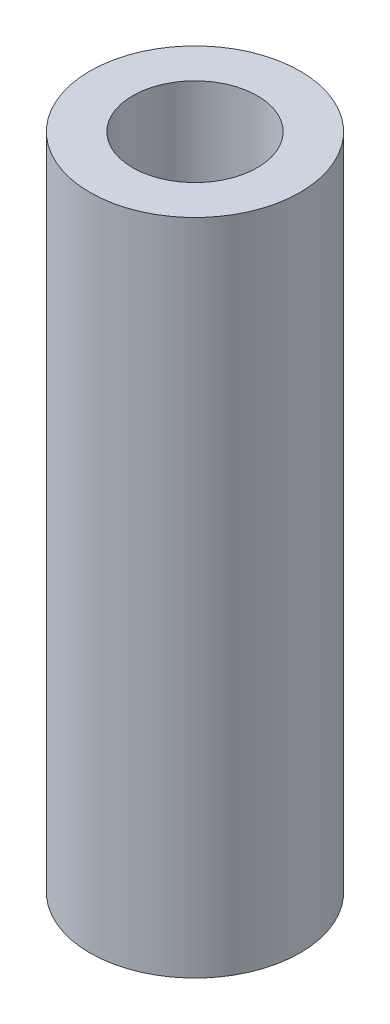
from build123d import *

# Parameters (mm, degrees)
SKETCH1_R           = 19.05
SKETCH1_R_2         = 11.303
BOSS_EXTRUDE1_DEPTH = 119.38
BOSS_EXTRUDE2_DEPTH = 69.85
CIRPATTERN1_COUNT   = 13


with BuildPart() as part:
    # Sketch1 → Boss-Extrude1 (new body)
    with BuildSketch(Plane(origin=(0, 0, 0), x_dir=(1, 0, 0), z_dir=(0, 1, 0))):
        with Locations(Location((0, 0, 0), (0, 0, 270))):
            Circle(SKETCH1_R)
        with Locations(Location((0, 0, 0), (0, 0, 270))):
            Circle(SKETCH1_R_2, mode=Mode.SUBTRACT)
    extrude(amount=-BOSS_EXTRUDE1_DEPTH)

    # Sketch2 → Boss-Extrude2 (add)
    with BuildSketch(Plane(origin=(0, -25.4, 0), x_dir=(-1, 0, 0), z_dir=(0, 1, 0))):
        with BuildLine():
            ThreePointArc((1.905, 11.141309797), (0, 11.303), (-1.905, 11.141309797))
            Line((-1.905, 11.141309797), (-1.078831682, 9.653959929))
            Line((-1.078831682, 9.653959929), (1.078831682, 9.653959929))
            Line((1.078831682, 9.653959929), (1.905, 11.141309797))
        make_face()
    boss_extrude2 = extrude(amount=-BOSS_EXTRUDE2_DEPTH)

    # CirPattern1: Boss-Extrude2 ×13 about axis
    cirpattern1_axis = Axis((0, 0, 0), (0, 1, 0))
    for i in range(1, CIRPATTERN1_COUNT):
        add(boss_extrude2.rotate(cirpattern1_axis, i * 360 / CIRPATTERN1_COUNT))


solid = part.part
